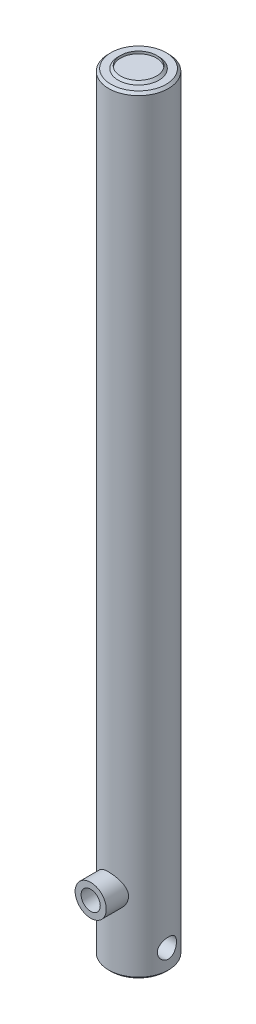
from build123d import *

# Parameters (mm, degrees)
ESQUISSE1_R                  = 25
EXTRUSION1_DEPTH             = 642
ESQUISSE2_R                  = 13
ESQUISSE2_R_2                = 8
EXTRUSION2_DEPTH             = 40
ENL_V_MAT_EXTRU_1_DEPTH      = 644.730533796
ENL_V_MAT_EXTRU_1_DEPTH_BACK = 644.730533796
ESQUISSE3_R                  = 8
CHANFREIN1_SIZE              = 2


with BuildPart() as part:
    # Esquisse1 → Extrusion1 (new body)
    with BuildSketch(Plane(origin=(0, 0, 0), x_dir=(1, 0, 0), z_dir=(0, 1, 0))):
        with Locations(Location((0, 0, 0), (0, 0, 270))):
            Circle(ESQUISSE1_R)
    extrude(amount=EXTRUSION1_DEPTH)

    # Esquisse2 → Extrusion2 (add)
    with BuildSketch(Plane.XY):
        with Locations(Location((0, 60, 0), (0, 0, 180))):
            Circle(ESQUISSE2_R)
        with Locations(Location((0, 60, 0), (0, 0, 180))):
            Circle(ESQUISSE2_R_2, mode=Mode.SUBTRACT)
    extrude(amount=EXTRUSION2_DEPTH)

    # Esquisse3 → Enl_v. mat.-Extru.1 (cut, two sides: drawn at the far end of the back side and taken through both)
    with BuildSketch(Plane(origin=(0, 0, 0), x_dir=(0, 0, -1), z_dir=(1, 0, 0)).offset(-ENL_V_MAT_EXTRU_1_DEPTH_BACK)):
        with Locations((0, 18)):
            Circle(ESQUISSE3_R)
    extrude(amount=ENL_V_MAT_EXTRU_1_DEPTH + ENL_V_MAT_EXTRU_1_DEPTH_BACK, mode=Mode.SUBTRACT)

    # Chanfrein1
    chanfrein1_edges = [part.edges().sort_by_distance(p)[0] for p in [
        (0, 0, -25),
        (0, 642, -25),
    ]]
    chamfer(chanfrein1_edges, length=CHANFREIN1_SIZE)

    # Esquisse4 → R_volution1 (revolve)
    with BuildSketch(Plane(origin=(0, 0, 0), x_dir=(0, 0, -1), z_dir=(1, 0, 0)), mode=Mode.PRIVATE) as r_volution1_sk:
        Polygon((15, 642), (15, 644), (17, 642), align=None)
    revolve(r_volution1_sk.sketch.rotate(Axis((0, -32.2, 0), (0, 1, 0)), 180), axis=Axis((0, -32.2, 0), (0, 1, 0)))


solid = part.part
